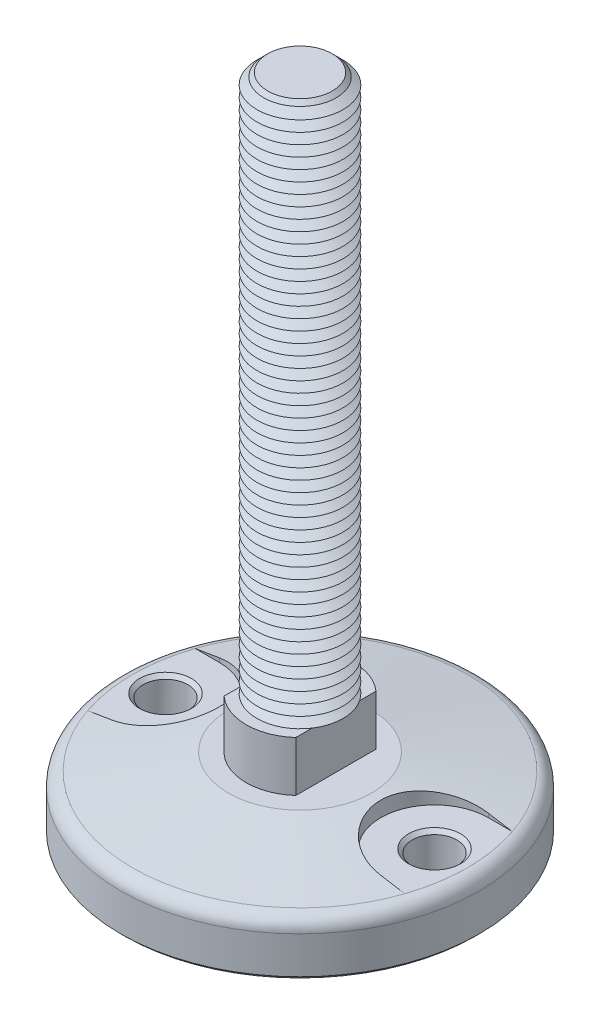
from build123d import *

# Parameters (mm, degrees)
FILLET1_R                = 4
SKETCH3_R                = 15
BOSS_EXTRUDE1_DEPTH      = 14
CUT_EXTRUDE1_START       = -14
CUT_EXTRUDE1_DEPTH       = 14
SKETCH5_R                = 12
BOSS_EXTRUDE2_DEPTH      = 150
CHAMFER1_SIZE            = 3
LPATTERN1_COUNT          = 50
LPATTERN1_PITCH          = 3
CUT_EXTRUDE4_DEPTH       = 4.7
SKETCH10_R               = 6.25
CUT_EXTRUDE5_DEPTH       = 15.3
CHAMFER2_SIZE            = 1
CHAMFER2_OF_MIRROR1_SIZE = 1
CHAMFER3_SIZE            = 1


with BuildPart() as part:
    # Sketch2 → Revolve1 (revolve)
    with BuildSketch(Plane(origin=(0, 0, 0), x_dir=(0, 0, -1), z_dir=(1, 0, 0))):
        Polygon((0, 0), (-20, 0), (-50, -5.289809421), (-50, -20), (0, -20), align=None)
    revolve(axis=Axis((0, 61.338865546, 0), (0, -1, 0)))

    # Fillet1
    fillet1_edges = [part.edges().sort_by_distance(p)[0] for p in [
        (0, -5.289809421, -50),
    ]]
    fillet(fillet1_edges, radius=FILLET1_R)

    # Sketch3 → Boss-Extrude1 (add)
    with BuildSketch(Plane(origin=(0, 0, 0), x_dir=(1, 0, 0), z_dir=(0, 1, 0))):
        with Locations(Location((0, 0, 0), (0, 0, 270))):
            Circle(SKETCH3_R)
    extrude(amount=BOSS_EXTRUDE1_DEPTH)

    # Sketch4 → Cut-Extrude1 (cut)
    with BuildSketch(Plane(origin=(0, 14, 0), x_dir=(1, 0, 0), z_dir=(0, 1, 0)).offset(CUT_EXTRUDE1_START)):
        with BuildLine():
            Line((-10, 11.180339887), (-10, -11.180339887))
            ThreePointArc((-10, -11.180339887), (-15, 0), (-10, 11.180339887))
        make_face()
        with BuildLine():
            Line((10, -11.180339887), (10, 11.180339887))
            ThreePointArc((10, 11.180339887), (15, 0), (10, -11.180339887))
        make_face()
    extrude(amount=CUT_EXTRUDE1_DEPTH, mode=Mode.SUBTRACT)

    # Sketch5 → Boss-Extrude2 (add)
    with BuildSketch(Plane(origin=(0, 14, 0), x_dir=(1, 0, 0), z_dir=(0, 1, 0))):
        with Locations(Location((0, 0, 0), (0, 0, 33.557309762))):
            Circle(SKETCH5_R)
    extrude(amount=BOSS_EXTRUDE2_DEPTH)

    # Chamfer1
    chamfer1_edges = [part.edges().sort_by_distance(p)[0] for p in [
        (-10, 164, 6.633249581),
    ]]
    chamfer(chamfer1_edges, length=CHAMFER1_SIZE)

    # Sketch6 → Cut-Revolve1 (revolve, cut)
    with BuildSketch(Plane(origin=(0, 0, 0), x_dir=(0, 0, -1), z_dir=(1, 0, 0))):
        Polygon((-12, 14), (-9.401923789, 15.5), (-12, 17), align=None)
    cut_revolve1 = revolve(axis=Axis((0, 61.338865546, 0), (0, -1, 0)), mode=Mode.SUBTRACT)

    # LPattern1: Cut-Revolve1 ×50
    with Locations(*[(0, i * LPATTERN1_PITCH, 0) for i in range(1, LPATTERN1_COUNT)]):
        add(cut_revolve1, mode=Mode.SUBTRACT)

    # Sketch8 → Cut-Extrude4 (cut)
    with BuildSketch(Plane(origin=(0, 0, 0), x_dir=(1, 0, 0), z_dir=(0, 1, 0))):
        with BuildLine():
            Line((-37.5, 15), (-44.219735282, 15))
            ThreePointArc((-44.219735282, 15), (-46.694592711, 0), (-44.219735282, -15))
            Line((-44.219735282, -15), (-37.5, -15))
            ThreePointArc((-37.5, -15), (-22.5, 0), (-37.5, 15))
        make_face()
    cut_extrude4 = extrude(amount=-CUT_EXTRUDE4_DEPTH, mode=Mode.SUBTRACT)

    # Sketch10 → Cut-Extrude5 (cut)
    with BuildSketch(Plane(origin=(0, -4.7, 0), x_dir=(1, 0, 0), z_dir=(0, 1, 0))):
        with Locations(Location((-37.5, 0, 0), (0, 0, 270))):
            Circle(SKETCH10_R)
    cut_extrude5 = extrude(amount=-CUT_EXTRUDE5_DEPTH, mode=Mode.SUBTRACT)

    # Chamfer2
    chamfer2_edges = [part.edges().sort_by_distance(p)[0] for p in [
        (-37.5, -4.7, -6.25),
        (-37.5, -20, -6.25),
    ]]
    chamfer(chamfer2_edges, length=CHAMFER2_SIZE)

    # Mirror1: Cut-Extrude4, Cut-Extrude5 across plane
    add(cut_extrude4.mirror(Plane(origin=(0, 0, 0), x_dir=(0, 0, 1), z_dir=(1, 0, 0))), mode=Mode.SUBTRACT)
    add(cut_extrude5.mirror(Plane(origin=(0, 0, 0), x_dir=(0, 0, 1), z_dir=(1, 0, 0))), mode=Mode.SUBTRACT)

    # Chamfer2 of Mirror1
    chamfer2_of_mirror1_edges = [part.edges().sort_by_distance(p)[0] for p in [
        (37.5, -4.7, -6.25),
        (37.5, -20, -6.25),
    ]]
    chamfer(chamfer2_of_mirror1_edges, length=CHAMFER2_OF_MIRROR1_SIZE)

    # Chamfer3
    chamfer3_edges = [part.edges().sort_by_distance(p)[0] for p in [
        (0, -20, -50),
    ]]
    chamfer(chamfer3_edges, length=CHAMFER3_SIZE)


solid = part.part
